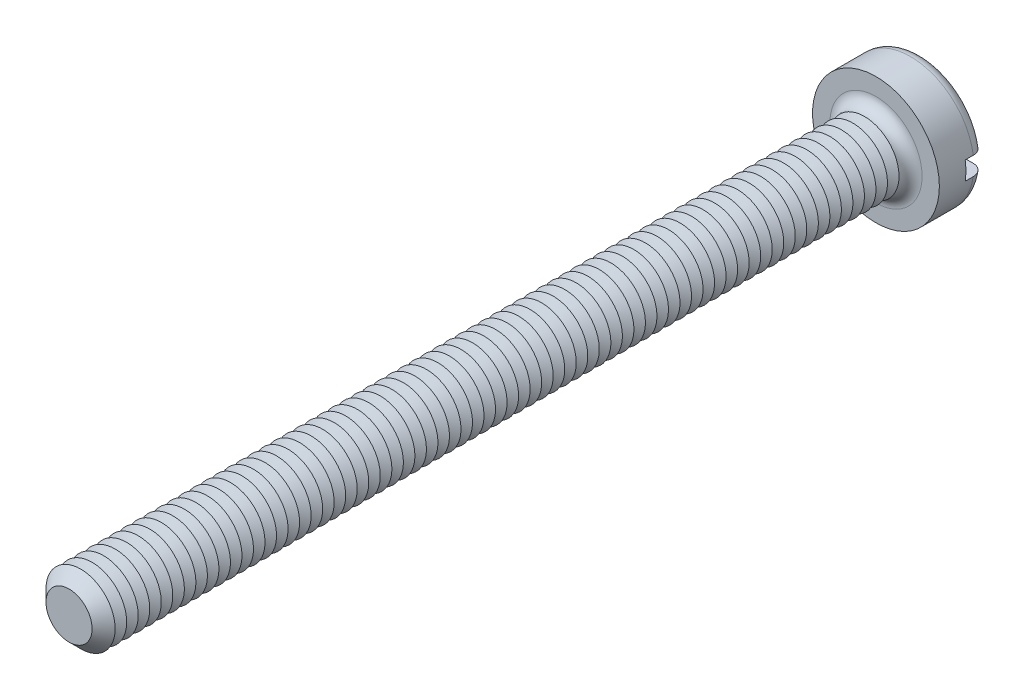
from build123d import *

# Parameters (mm, degrees)
SKETCH3_R           = 2.75
BOSS_EXTRUDE2_DEPTH = 2
SKETCH4_R           = 1.5
BOSS_EXTRUDE3_DEPTH = 35
FILLET1_R           = 0.5
CHAMFER1_SIZE       = 0.5
LPATTERN1_COUNT     = 68
LPATTERN1_PITCH     = 0.5
SKETCH8_W           = 5.5
SKETCH8_H           = 0.8
CUT_EXTRUDE1_DEPTH  = 0.85


with BuildPart() as part:
    # Sketch3 → Boss-Extrude2 (new body)
    with BuildSketch(Plane.XY):
        Circle(SKETCH3_R)
    extrude(amount=-BOSS_EXTRUDE2_DEPTH)

    # Sketch4 → Boss-Extrude3 (add)
    with BuildSketch(Plane.XY):
        Circle(SKETCH4_R)
    extrude(amount=BOSS_EXTRUDE3_DEPTH)

    # Fillet1
    fillet1_edges = [part.edges().sort_by_distance(p)[0] for p in [
        (-2.75, 0, -2),
        (-1.5, 0, 0),
    ]]
    fillet(fillet1_edges, radius=FILLET1_R)

    # Chamfer1
    chamfer1_edges = [part.edges().sort_by_distance(p)[0] for p in [
        (-1.5, 0, 35),
    ]]
    chamfer(chamfer1_edges, length=CHAMFER1_SIZE)

    # Sketch6 → Cut-Revolve1 (revolve, cut)
    with BuildSketch(Plane(origin=(0, 0, 0), x_dir=(0, 0, -1), z_dir=(1, 0, 0)), mode=Mode.PRIVATE) as cut_revolve1_sk:
        Polygon((-0.5, 1.5), (-0.75, 1.066987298), (-1, 1.5), align=None)
    cut_revolve1 = revolve(cut_revolve1_sk.sketch.rotate(Axis((0, 0, -1.694361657), (0, 0, 1)), 90), axis=Axis((0, 0, -1.694361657), (0, 0, 1)), mode=Mode.SUBTRACT)

    # LPattern1: Cut-Revolve1 ×68
    with Locations(*[(0, 0, i * LPATTERN1_PITCH) for i in range(1, LPATTERN1_COUNT)]):
        add(cut_revolve1, mode=Mode.SUBTRACT)

    # Sketch8 → Cut-Extrude1 (cut)
    with BuildSketch(Plane(origin=(0, 0, -2), x_dir=(-1, 0, 0), z_dir=(0, 0, -1))):
        Rectangle(SKETCH8_W, SKETCH8_H)
    extrude(amount=-CUT_EXTRUDE1_DEPTH, mode=Mode.SUBTRACT)


solid = part.part
